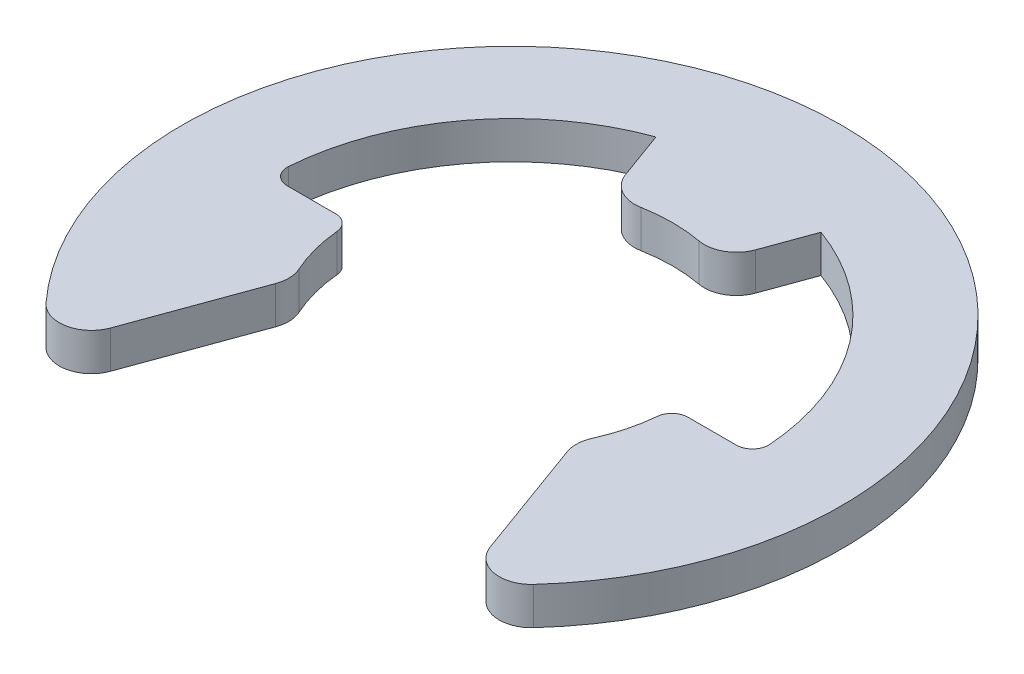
from build123d import *

# Parameters (mm, degrees)
BOSS_EXTRUDE1_DEPTH = 0.35
FILLET1_R           = 0.6
FILLET2_R           = 0.3


with BuildPart() as part:
    # Sketch2 → Boss-Extrude1 (new, symmetric)
    with BuildSketch(Plane(origin=(0, 0, 0), x_dir=(1, 0, 0), z_dir=(0, 1, 0))):
        with BuildLine():
            Line((-3.850173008, -4.79569263), (-2.63, -1.443294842))
            ThreePointArc((-2.63, -1.443294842), (-2.906028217, -0.744983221), (-3, 0))
            Line((-3, 0), (-4.5, 0))
            ThreePointArc((-4.5, 0), (-3.686184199, 2.581093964), (-1.539090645, 4.228616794))
            Line((-1.539090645, 4.228616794), (-1.02606043, 2.819077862))
            ThreePointArc((-1.02606043, 2.819077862), (0, 3), (1.02606043, 2.819077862))
            Line((1.02606043, 2.819077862), (1.539090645, 4.228616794))
            ThreePointArc((1.539090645, 4.228616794), (3.686184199, 2.581093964), (4.5, 0))
            Line((4.5, 0), (3, 0))
            ThreePointArc((3, 0), (2.906028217, -0.744983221), (2.63, -1.443294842))
            Line((2.63, -1.443294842), (3.850173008, -4.79569263))
            ThreePointArc((3.850173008, -4.79569263), (0, 6.15), (-3.850173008, -4.79569263))
        make_face()
    extrude(amount=BOSS_EXTRUDE1_DEPTH, both=True)

    # Fillet1
    fillet1_edges = [part.edges().sort_by_distance(p)[0] for p in [
        (-2.63, 0, 1.443294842),
        (-3.850173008, 0, 4.79569263),
        (3.850173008, 0, 4.79569263),
        (2.63, 0, 1.443294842),
        (1.02606043, 0, -2.819077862),
        (-1.02606043, 0, -2.819077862),
    ]]
    fillet(fillet1_edges, radius=FILLET1_R)

    # Fillet2
    fillet2_edges = [part.edges().sort_by_distance(p)[0] for p in [
        (-4.5, 0, 0),
        (-3, 0, 0),
        (3, 0, 0),
        (4.5, 0, 0),
    ]]
    fillet(fillet2_edges, radius=FILLET2_R)


solid = part.part
